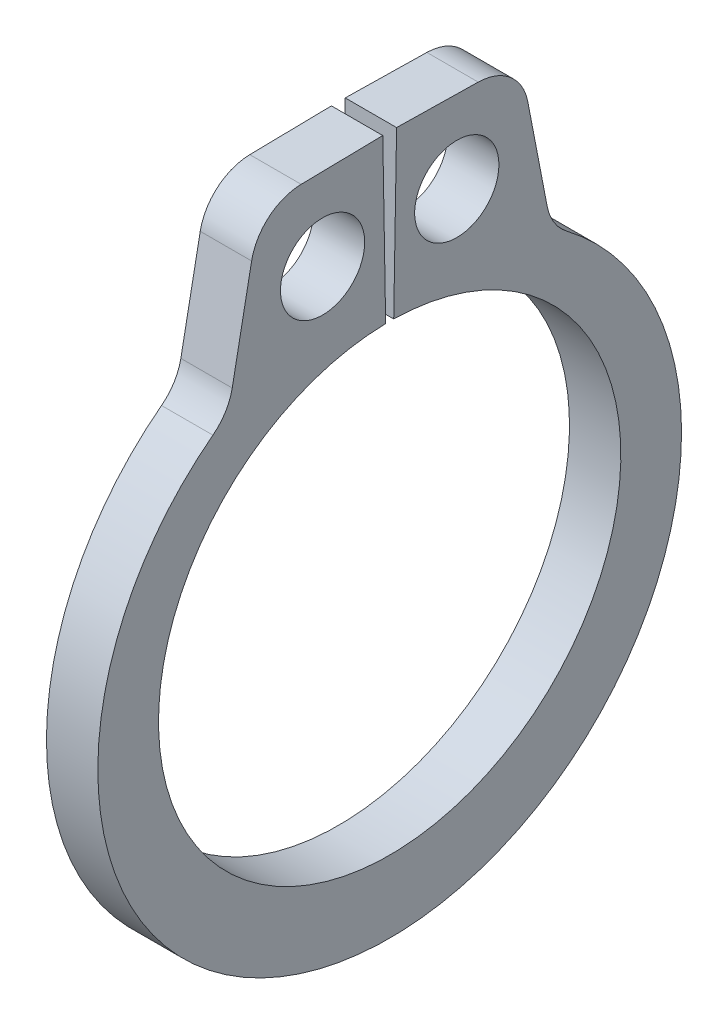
from build123d import *

# Parameters (mm, degrees)
SKETCH1_R      = 0.5207
EXTRUDE1_DEPTH = 0.3175
FILLET1_R      = 0.635


with BuildPart() as part:
    # Sketch1 → Extrude1 (new, symmetric)
    with BuildSketch(Plane(origin=(0, 0, 0), x_dir=(0, 0, -1), z_dir=(1, 0, 0))):
        with BuildLine():
            Line((-0.049870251, 2.857064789), (-0.085333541, 4.888755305))
            Line((-0.085333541, 4.888755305), (-1.609101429, 4.862157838))
            Line((-1.609101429, 4.862157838), (-1.994422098, 2.867025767))
            ThreePointArc((-1.994422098, 2.867025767), (0, -3.7465), (1.994422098, 2.867025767))
            Line((1.994422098, 2.867025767), (1.609101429, 4.862157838))
            Line((1.609101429, 4.862157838), (0.085333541, 4.888755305))
            Line((0.085333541, 4.888755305), (0.049870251, 2.857064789))
            ThreePointArc((0.049870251, 2.857064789), (0, -2.8575), (-0.049870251, 2.857064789))
        make_face()
        with Locations((-0.82948584, 3.859611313)):
            Circle(SKETCH1_R, mode=Mode.SUBTRACT)
        with Locations((0.82948584, 3.859611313)):
            Circle(SKETCH1_R, mode=Mode.SUBTRACT)
    extrude(amount=EXTRUDE1_DEPTH, both=True)

    # Fillet1
    fillet1_edges = [part.edges().sort_by_distance(p)[0] for p in [
        (0, 4.862157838, -1.609101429),
        (0, 2.867025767, -1.994422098),
        (0, 2.867025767, 1.994422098),
        (0, 4.862157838, 1.609101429),
    ]]
    fillet(fillet1_edges, radius=FILLET1_R)


solid = part.part
